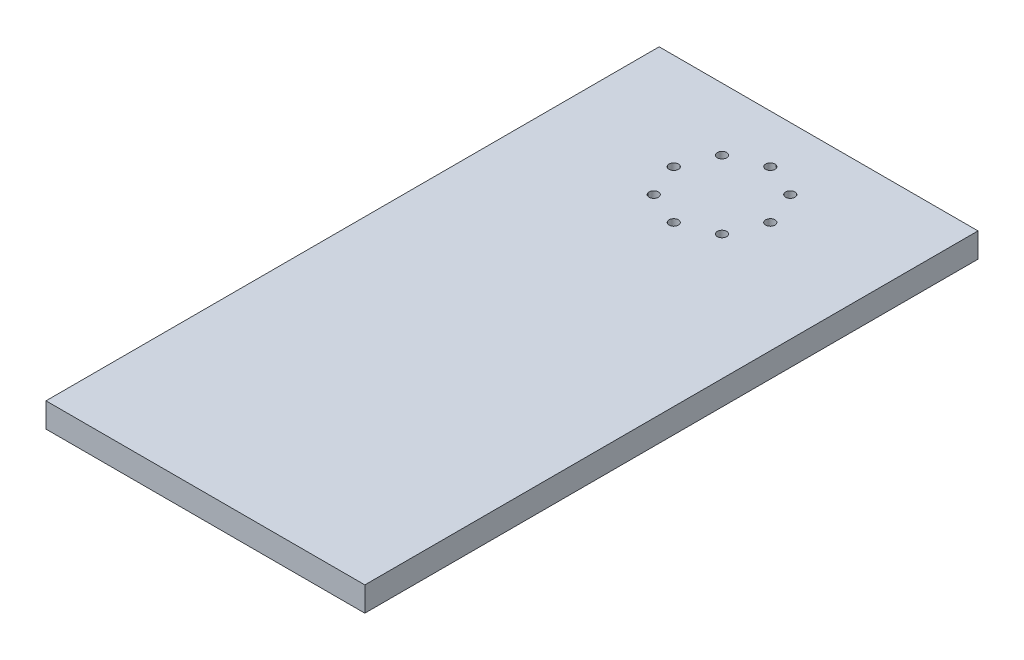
from build123d import *

# Parameters (mm, degrees)
SKETCH1_W          = 165.1
SKETCH1_H          = 317.5
BASE_EXTRUDE_DEPTH = 12.7
SKETCH13_R         = 2.415
CUT_EXTRUDE4_DEPTH = 281.235690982
CIRPATTERN1_COUNT  = 8


with BuildPart() as part:
    # Sketch1 → Base_extrude (new body)
    with BuildSketch(Plane(origin=(0, 0, 0), x_dir=(1, 0, 0), z_dir=(0, 1, 0))):
        with Locations((0, -108.75)):
            Rectangle(SKETCH1_W, SKETCH1_H)
    extrude(amount=-BASE_EXTRUDE_DEPTH)

    # Sketch13 → Cut-Extrude4 (cut, through all)
    with BuildSketch(Plane(origin=(0, 0, 0), x_dir=(1, 0, 0), z_dir=(0, 1, 0))):
        with Locations(Location((-17.67766953, -17.67766953, 0), (0, 0, 270))):
            Circle(SKETCH13_R)
    cut_extrude4 = extrude(amount=-CUT_EXTRUDE4_DEPTH, mode=Mode.SUBTRACT)

    # CirPattern1: Cut-Extrude4 ×8 about axis
    cirpattern1_axis = Axis((0, 0, 0), (0, 1, 0))
    for i in range(1, CIRPATTERN1_COUNT):
        add(cut_extrude4.rotate(cirpattern1_axis, i * 360 / CIRPATTERN1_COUNT), mode=Mode.SUBTRACT)


solid = part.part
